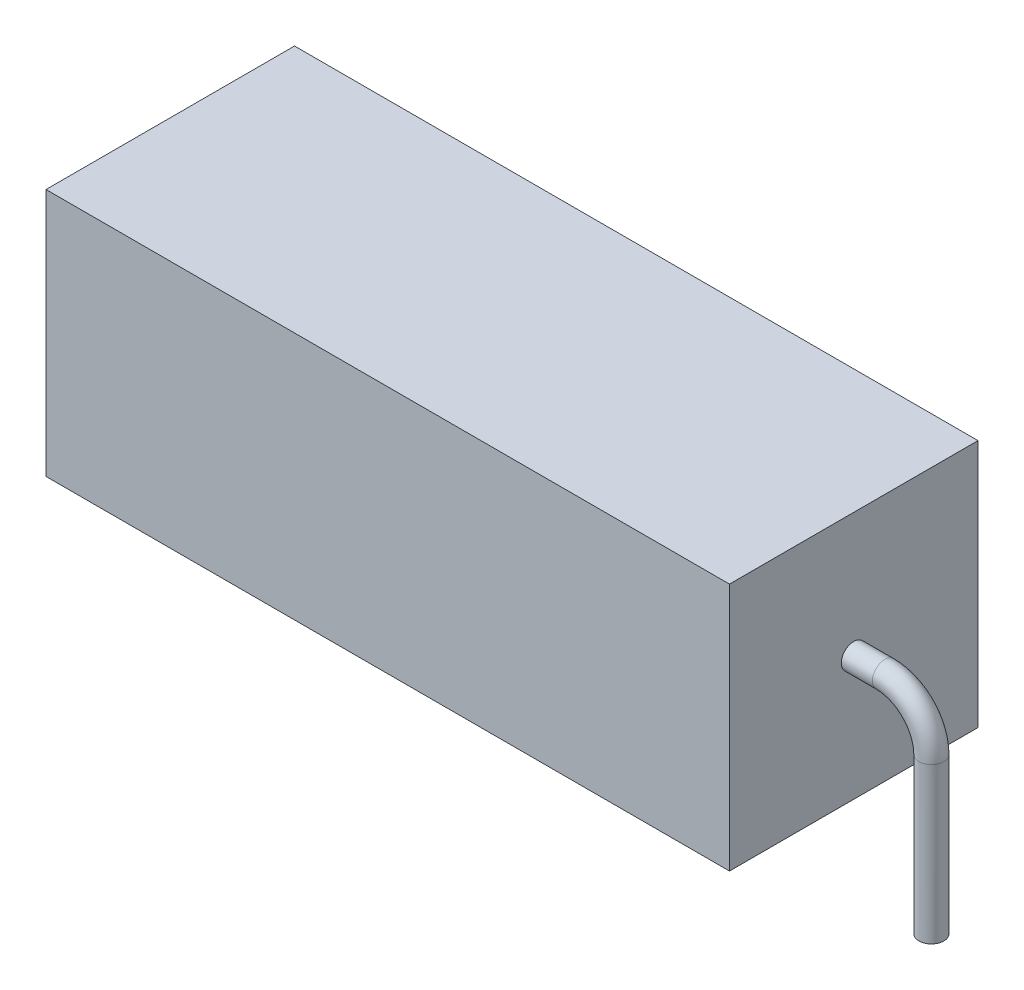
ISO-10303-21;
HEADER;
FILE_DESCRIPTION(('STEP AP214'),'2;1');
FILE_NAME('part.step','',(''),(''),'','','');
FILE_SCHEMA(('AUTOMOTIVE_DESIGN { 1 0 10303 214 1 1 1 1 }'));
ENDSEC;
DATA;
#1=APPLICATION_CONTEXT('core data for automotive mechanical design processes');
#2=APPLICATION_PROTOCOL_DEFINITION('international standard','automotive_design',2000,#1);
#3=PRODUCT_CONTEXT('',#1,'mechanical');
#4=PRODUCT('Part','Part','',(#3));
#5=PRODUCT_RELATED_PRODUCT_CATEGORY('part','',(#4));
#6=PRODUCT_DEFINITION_FORMATION('','',#4);
#7=PRODUCT_DEFINITION_CONTEXT('part definition',#1,'design');
#8=PRODUCT_DEFINITION('design','',#6,#7);
#9=PRODUCT_DEFINITION_SHAPE('','',#8);
#10=(LENGTH_UNIT() NAMED_UNIT(*) SI_UNIT(.MILLI.,.METRE.));
#11=(NAMED_UNIT(*) PLANE_ANGLE_UNIT() SI_UNIT($,.RADIAN.));
#12=(NAMED_UNIT(*) SI_UNIT($,.STERADIAN.) SOLID_ANGLE_UNIT());
#13=UNCERTAINTY_MEASURE_WITH_UNIT(LENGTH_MEASURE(1.E-05),#10,'distance_accuracy_value','');
#14=(GEOMETRIC_REPRESENTATION_CONTEXT(3) GLOBAL_UNCERTAINTY_ASSIGNED_CONTEXT((#13)) GLOBAL_UNIT_ASSIGNED_CONTEXT((#10,
#11,#12)) REPRESENTATION_CONTEXT('',''));
#15=CARTESIAN_POINT('',(0.,0.,0.));
#16=DIRECTION('',(0.,0.,1.));
#17=DIRECTION('',(1.,0.,0.));
#18=AXIS2_PLACEMENT_3D('',#15,#16,#17);
#19=CARTESIAN_POINT('',(22.,8.,0.));
#20=DIRECTION('',(-1.,0.,0.));
#21=DIRECTION('',(0.,0.,1.));
#22=AXIS2_PLACEMENT_3D('',#19,#20,#21);
#23=PLANE('',#22);
#24=DIRECTION('',(0.,-1.,0.));
#25=VECTOR('',#24,1.);
#26=CARTESIAN_POINT('',(22.,0.,0.));
#27=LINE('',#26,#25);
#28=CARTESIAN_POINT('',(22.,8.,0.));
#29=VERTEX_POINT('',#28);
#30=CARTESIAN_POINT('',(22.,0.,0.));
#31=VERTEX_POINT('',#30);
#32=EDGE_CURVE('E105',#29,#31,#27,.T.);
#33=ORIENTED_EDGE('',*,*,#32,.T.);
#34=DIRECTION('',(0.,0.,-1.));
#35=VECTOR('',#34,1.);
#36=CARTESIAN_POINT('',(22.,0.,0.));
#37=LINE('',#36,#35);
#38=CARTESIAN_POINT('',(22.,0.,-8.));
#39=VERTEX_POINT('',#38);
#40=EDGE_CURVE('E88',#31,#39,#37,.T.);
#41=ORIENTED_EDGE('',*,*,#40,.T.);
#42=DIRECTION('',(0.,1.,0.));
#43=VECTOR('',#42,1.);
#44=CARTESIAN_POINT('',(22.,0.,-8.));
#45=LINE('',#44,#43);
#46=CARTESIAN_POINT('',(22.,8.,-8.));
#47=VERTEX_POINT('',#46);
#48=EDGE_CURVE('E53',#39,#47,#45,.T.);
#49=ORIENTED_EDGE('',*,*,#48,.T.);
#50=DIRECTION('',(0.,0.,1.));
#51=VECTOR('',#50,1.);
#52=CARTESIAN_POINT('',(22.,8.,0.));
#53=LINE('',#52,#51);
#54=EDGE_CURVE('E48',#47,#29,#53,.T.);
#55=ORIENTED_EDGE('',*,*,#54,.T.);
#56=EDGE_LOOP('',(#33,#41,#49,#55));
#57=FACE_BOUND('',#56,.T.);
#58=CARTESIAN_POINT('',(22.,4.,-4.));
#59=DIRECTION('',(-1.,0.,0.));
#60=DIRECTION('',(0.,0.,1.));
#61=AXIS2_PLACEMENT_3D('',#58,#59,#60);
#62=CIRCLE('',#61,0.4);
#63=CARTESIAN_POINT('',(22.,4.,-3.6));
#64=VERTEX_POINT('',#63);
#65=EDGE_CURVE('E41',#64,#64,#62,.F.);
#66=ORIENTED_EDGE('',*,*,#65,.F.);
#67=EDGE_LOOP('',(#66));
#68=FACE_BOUND('',#67,.T.);
#69=ADVANCED_FACE('F33',(#57,#68),#23,.F.);
#70=CARTESIAN_POINT('',(22.,0.,0.));
#71=DIRECTION('',(0.,0.,-1.));
#72=DIRECTION('',(-1.,0.,0.));
#73=AXIS2_PLACEMENT_3D('',#70,#71,#72);
#74=PLANE('',#73);
#75=DIRECTION('',(0.,-1.,0.));
#76=VECTOR('',#75,1.);
#77=CARTESIAN_POINT('',(0.,0.,0.));
#78=LINE('',#77,#76);
#79=CARTESIAN_POINT('',(0.,8.,0.));
#80=VERTEX_POINT('',#79);
#81=CARTESIAN_POINT('',(0.,0.,0.));
#82=VERTEX_POINT('',#81);
#83=EDGE_CURVE('E79',#80,#82,#78,.T.);
#84=ORIENTED_EDGE('',*,*,#83,.T.);
#85=DIRECTION('',(-1.,0.,0.));
#86=VECTOR('',#85,1.);
#87=CARTESIAN_POINT('',(22.,0.,0.));
#88=LINE('',#87,#86);
#89=EDGE_CURVE('E86',#31,#82,#88,.T.);
#90=ORIENTED_EDGE('',*,*,#89,.F.);
#91=ORIENTED_EDGE('',*,*,#32,.F.);
#92=DIRECTION('',(-1.,0.,0.));
#93=VECTOR('',#92,1.);
#94=CARTESIAN_POINT('',(22.,8.,0.));
#95=LINE('',#94,#93);
#96=EDGE_CURVE('E94',#29,#80,#95,.T.);
#97=ORIENTED_EDGE('',*,*,#96,.T.);
#98=EDGE_LOOP('',(#84,#90,#91,#97));
#99=FACE_BOUND('',#98,.T.);
#100=ADVANCED_FACE('F35',(#99),#74,.F.);
#101=CARTESIAN_POINT('',(22.,0.,0.));
#102=DIRECTION('',(0.,1.,0.));
#103=DIRECTION('',(0.,0.,1.));
#104=AXIS2_PLACEMENT_3D('',#101,#102,#103);
#105=PLANE('',#104);
#106=DIRECTION('',(0.,0.,-1.));
#107=VECTOR('',#106,1.);
#108=CARTESIAN_POINT('',(0.,0.,0.));
#109=LINE('',#108,#107);
#110=CARTESIAN_POINT('',(0.,0.,-8.));
#111=VERTEX_POINT('',#110);
#112=EDGE_CURVE('E74',#82,#111,#109,.T.);
#113=ORIENTED_EDGE('',*,*,#112,.T.);
#114=DIRECTION('',(-1.,0.,0.));
#115=VECTOR('',#114,1.);
#116=CARTESIAN_POINT('',(22.,0.,-8.));
#117=LINE('',#116,#115);
#118=EDGE_CURVE('E91',#39,#111,#117,.T.);
#119=ORIENTED_EDGE('',*,*,#118,.F.);
#120=ORIENTED_EDGE('',*,*,#40,.F.);
#121=ORIENTED_EDGE('',*,*,#89,.T.);
#122=EDGE_LOOP('',(#113,#119,#120,#121));
#123=FACE_BOUND('',#122,.T.);
#124=ADVANCED_FACE('F87',(#123),#105,.F.);
#125=CARTESIAN_POINT('',(22.,0.,-8.));
#126=DIRECTION('',(0.,0.,1.));
#127=DIRECTION('',(1.,0.,0.));
#128=AXIS2_PLACEMENT_3D('',#125,#126,#127);
#129=PLANE('',#128);
#130=DIRECTION('',(0.,1.,0.));
#131=VECTOR('',#130,1.);
#132=CARTESIAN_POINT('',(0.,0.,-8.));
#133=LINE('',#132,#131);
#134=CARTESIAN_POINT('',(0.,8.,-8.));
#135=VERTEX_POINT('',#134);
#136=EDGE_CURVE('E80',#111,#135,#133,.T.);
#137=ORIENTED_EDGE('',*,*,#136,.T.);
#138=DIRECTION('',(-1.,0.,0.));
#139=VECTOR('',#138,1.);
#140=CARTESIAN_POINT('',(22.,8.,-8.));
#141=LINE('',#140,#139);
#142=EDGE_CURVE('E111',#47,#135,#141,.T.);
#143=ORIENTED_EDGE('',*,*,#142,.F.);
#144=ORIENTED_EDGE('',*,*,#48,.F.);
#145=ORIENTED_EDGE('',*,*,#118,.T.);
#146=EDGE_LOOP('',(#137,#143,#144,#145));
#147=FACE_BOUND('',#146,.T.);
#148=ADVANCED_FACE('F130',(#147),#129,.F.);
#149=CARTESIAN_POINT('',(22.,8.,0.));
#150=DIRECTION('',(0.,-1.,0.));
#151=DIRECTION('',(0.,0.,-1.));
#152=AXIS2_PLACEMENT_3D('',#149,#150,#151);
#153=PLANE('',#152);
#154=DIRECTION('',(0.,0.,1.));
#155=VECTOR('',#154,1.);
#156=CARTESIAN_POINT('',(0.,8.,0.));
#157=LINE('',#156,#155);
#158=EDGE_CURVE('E103',#135,#80,#157,.T.);
#159=ORIENTED_EDGE('',*,*,#158,.T.);
#160=ORIENTED_EDGE('',*,*,#96,.F.);
#161=ORIENTED_EDGE('',*,*,#54,.F.);
#162=ORIENTED_EDGE('',*,*,#142,.T.);
#163=EDGE_LOOP('',(#159,#160,#161,#162));
#164=FACE_BOUND('',#163,.T.);
#165=ADVANCED_FACE('F127',(#164),#153,.F.);
#166=CARTESIAN_POINT('',(0.,8.,0.));
#167=DIRECTION('',(-1.,0.,0.));
#168=DIRECTION('',(0.,0.,1.));
#169=AXIS2_PLACEMENT_3D('',#166,#167,#168);
#170=PLANE('',#169);
#171=CARTESIAN_POINT('',(0.,4.,-4.));
#172=DIRECTION('',(-1.,0.,0.));
#173=DIRECTION('',(0.,0.,1.));
#174=AXIS2_PLACEMENT_3D('',#171,#172,#173);
#175=CIRCLE('',#174,0.4);
#176=CARTESIAN_POINT('',(0.,4.,-3.6));
#177=VERTEX_POINT('',#176);
#178=EDGE_CURVE('E11',#177,#177,#175,.T.);
#179=ORIENTED_EDGE('',*,*,#178,.F.);
#180=EDGE_LOOP('',(#179));
#181=FACE_BOUND('',#180,.T.);
#182=ORIENTED_EDGE('',*,*,#83,.F.);
#183=ORIENTED_EDGE('',*,*,#158,.F.);
#184=ORIENTED_EDGE('',*,*,#136,.F.);
#185=ORIENTED_EDGE('',*,*,#112,.F.);
#186=EDGE_LOOP('',(#182,#183,#184,#185));
#187=FACE_BOUND('',#186,.T.);
#188=ADVANCED_FACE('F76',(#181,#187),#170,.T.);
#189=CARTESIAN_POINT('',(24.5,2.5,-4.));
#190=DIRECTION('',(0.,-1.,0.));
#191=DIRECTION('',(0.,0.,-1.));
#192=AXIS2_PLACEMENT_3D('',#189,#190,#191);
#193=CYLINDRICAL_SURFACE('',#192,0.4);
#194=CARTESIAN_POINT('',(24.5,2.5,-4.));
#195=DIRECTION('',(0.,-1.,0.));
#196=DIRECTION('',(0.,0.,-1.));
#197=AXIS2_PLACEMENT_3D('',#194,#195,#196);
#198=CIRCLE('',#197,0.4);
#199=CARTESIAN_POINT('',(24.9,2.5,-4.));
#200=VERTEX_POINT('',#199);
#201=EDGE_CURVE('E98',#200,#200,#198,.T.);
#202=ORIENTED_EDGE('',*,*,#201,.T.);
#203=EDGE_LOOP('',(#202));
#204=FACE_BOUND('',#203,.T.);
#205=CARTESIAN_POINT('',(24.5,-2.5,-4.));
#206=DIRECTION('',(0.,-1.,0.));
#207=DIRECTION('',(0.,0.,-1.));
#208=AXIS2_PLACEMENT_3D('',#205,#206,#207);
#209=CIRCLE('',#208,0.4);
#210=CARTESIAN_POINT('',(24.5,-2.5,-4.4));
#211=VERTEX_POINT('',#210);
#212=EDGE_CURVE('E95',#211,#211,#209,.T.);
#213=ORIENTED_EDGE('',*,*,#212,.F.);
#214=EDGE_LOOP('',(#213));
#215=FACE_BOUND('',#214,.T.);
#216=ADVANCED_FACE('F153',(#204,#215),#193,.T.);
#217=CARTESIAN_POINT('',(23.,2.5,-4.));
#218=DIRECTION('',(0.,0.,-1.));
#219=DIRECTION('',(-1.,0.,0.));
#220=AXIS2_PLACEMENT_3D('',#217,#218,#219);
#221=TOROIDAL_SURFACE('',#220,1.5,0.4);
#222=CARTESIAN_POINT('',(23.,4.,-4.));
#223=DIRECTION('',(1.,0.,0.));
#224=DIRECTION('',(0.,0.,-1.));
#225=AXIS2_PLACEMENT_3D('',#222,#223,#224);
#226=CIRCLE('',#225,0.4);
#227=CARTESIAN_POINT('',(23.,4.4,-4.));
#228=VERTEX_POINT('',#227);
#229=EDGE_CURVE('E255',#228,#228,#226,.T.);
#230=CARTESIAN_POINT('',(23.,2.5,-4.));
#231=DIRECTION('',(0.,0.,-1.));
#232=DIRECTION('',(-1.,0.,0.));
#233=AXIS2_PLACEMENT_3D('',#230,#231,#232);
#234=CIRCLE('',#233,1.9);
#235=EDGE_CURVE('',#228,#200,#234,.T.);
#236=ORIENTED_EDGE('',*,*,#229,.T.);
#237=ORIENTED_EDGE('',*,*,#201,.F.);
#238=ORIENTED_EDGE('',*,*,#235,.T.);
#239=ORIENTED_EDGE('',*,*,#235,.F.);
#240=EDGE_LOOP('',(#236,#238,#237,#239));
#241=FACE_BOUND('',#240,.T.);
#242=ADVANCED_FACE('F162',(#241),#221,.T.);
#243=CARTESIAN_POINT('',(23.,4.,-4.));
#244=DIRECTION('',(-1.,0.,0.));
#245=DIRECTION('',(0.,0.,1.));
#246=AXIS2_PLACEMENT_3D('',#243,#244,#245);
#247=CYLINDRICAL_SURFACE('',#246,0.4);
#248=ORIENTED_EDGE('',*,*,#229,.F.);
#249=EDGE_LOOP('',(#248));
#250=FACE_BOUND('',#249,.T.);
#251=ORIENTED_EDGE('',*,*,#65,.T.);
#252=EDGE_LOOP('',(#251));
#253=FACE_BOUND('',#252,.T.);
#254=ADVANCED_FACE('F117',(#250,#253),#247,.T.);
#255=CARTESIAN_POINT('',(24.5,-2.5,-4.));
#256=DIRECTION('',(0.,-1.,0.));
#257=DIRECTION('',(0.,0.,-1.));
#258=AXIS2_PLACEMENT_3D('',#255,#256,#257);
#259=PLANE('',#258);
#260=ORIENTED_EDGE('',*,*,#212,.T.);
#261=EDGE_LOOP('',(#260));
#262=FACE_BOUND('',#261,.T.);
#263=ADVANCED_FACE('F176',(#262),#259,.T.);
#264=CARTESIAN_POINT('',(-2.5,2.5,-4.));
#265=DIRECTION('',(0.,-1.,0.));
#266=DIRECTION('',(0.,0.,-1.));
#267=AXIS2_PLACEMENT_3D('',#264,#265,#266);
#268=CYLINDRICAL_SURFACE('',#267,0.4);
#269=CARTESIAN_POINT('',(-2.5,2.5,-4.));
#270=DIRECTION('',(0.,1.,0.));
#271=DIRECTION('',(0.,0.,-1.));
#272=AXIS2_PLACEMENT_3D('',#269,#270,#271);
#273=CIRCLE('',#272,0.4);
#274=CARTESIAN_POINT('',(-2.9,2.5,-4.));
#275=VERTEX_POINT('',#274);
#276=EDGE_CURVE('E256',#275,#275,#273,.T.);
#277=ORIENTED_EDGE('',*,*,#276,.F.);
#278=EDGE_LOOP('',(#277));
#279=FACE_BOUND('',#278,.T.);
#280=CARTESIAN_POINT('',(-2.5,-2.5,-4.));
#281=DIRECTION('',(0.,1.,0.));
#282=DIRECTION('',(0.,0.,-1.));
#283=AXIS2_PLACEMENT_3D('',#280,#281,#282);
#284=CIRCLE('',#283,0.4);
#285=CARTESIAN_POINT('',(-2.5,-2.5,-4.4));
#286=VERTEX_POINT('',#285);
#287=EDGE_CURVE('E253',#286,#286,#284,.T.);
#288=ORIENTED_EDGE('',*,*,#287,.T.);
#289=EDGE_LOOP('',(#288));
#290=FACE_BOUND('',#289,.T.);
#291=ADVANCED_FACE('F183',(#279,#290),#268,.T.);
#292=CARTESIAN_POINT('',(-0.999999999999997,2.5,-4.));
#293=DIRECTION('',(0.,0.,1.));
#294=DIRECTION('',(1.,0.,0.));
#295=AXIS2_PLACEMENT_3D('',#292,#293,#294);
#296=TOROIDAL_SURFACE('',#295,1.5,0.4);
#297=CARTESIAN_POINT('',(-0.999999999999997,4.,-4.));
#298=DIRECTION('',(1.,0.,0.));
#299=DIRECTION('',(0.,0.,-1.));
#300=AXIS2_PLACEMENT_3D('',#297,#298,#299);
#301=CIRCLE('',#300,0.4);
#302=CARTESIAN_POINT('',(-0.999999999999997,4.4,-4.));
#303=VERTEX_POINT('',#302);
#304=EDGE_CURVE('E261',#303,#303,#301,.T.);
#305=CARTESIAN_POINT('',(-0.999999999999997,2.5,-4.));
#306=DIRECTION('',(0.,0.,1.));
#307=DIRECTION('',(1.,0.,0.));
#308=AXIS2_PLACEMENT_3D('',#305,#306,#307);
#309=CIRCLE('',#308,1.9);
#310=EDGE_CURVE('',#303,#275,#309,.T.);
#311=ORIENTED_EDGE('',*,*,#304,.F.);
#312=ORIENTED_EDGE('',*,*,#276,.T.);
#313=ORIENTED_EDGE('',*,*,#310,.T.);
#314=ORIENTED_EDGE('',*,*,#310,.F.);
#315=EDGE_LOOP('',(#311,#313,#312,#314));
#316=FACE_BOUND('',#315,.T.);
#317=ADVANCED_FACE('F190',(#316),#296,.T.);
#318=CARTESIAN_POINT('',(-0.999999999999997,4.,-4.));
#319=DIRECTION('',(1.,0.,0.));
#320=DIRECTION('',(0.,0.,-1.));
#321=AXIS2_PLACEMENT_3D('',#318,#319,#320);
#322=CYLINDRICAL_SURFACE('',#321,0.4);
#323=ORIENTED_EDGE('',*,*,#304,.T.);
#324=EDGE_LOOP('',(#323));
#325=FACE_BOUND('',#324,.T.);
#326=ORIENTED_EDGE('',*,*,#178,.T.);
#327=EDGE_LOOP('',(#326));
#328=FACE_BOUND('',#327,.T.);
#329=ADVANCED_FACE('F198',(#325,#328),#322,.T.);
#330=CARTESIAN_POINT('',(-2.5,-2.5,-4.));
#331=DIRECTION('',(0.,-1.,0.));
#332=DIRECTION('',(0.,0.,-1.));
#333=AXIS2_PLACEMENT_3D('',#330,#331,#332);
#334=PLANE('',#333);
#335=ORIENTED_EDGE('',*,*,#287,.F.);
#336=EDGE_LOOP('',(#335));
#337=FACE_BOUND('',#336,.T.);
#338=ADVANCED_FACE('F206',(#337),#334,.T.);
#339=CLOSED_SHELL('',(#69,#100,#124,#148,#165,#188,#216,#242,#254,#263,#291,#317,#329,#338));
#340=MANIFOLD_SOLID_BREP('B2',#339);
#341=ADVANCED_BREP_SHAPE_REPRESENTATION('',(#18,#340),#14);
#342=SHAPE_DEFINITION_REPRESENTATION(#9,#341);
ENDSEC;
END-ISO-10303-21;
